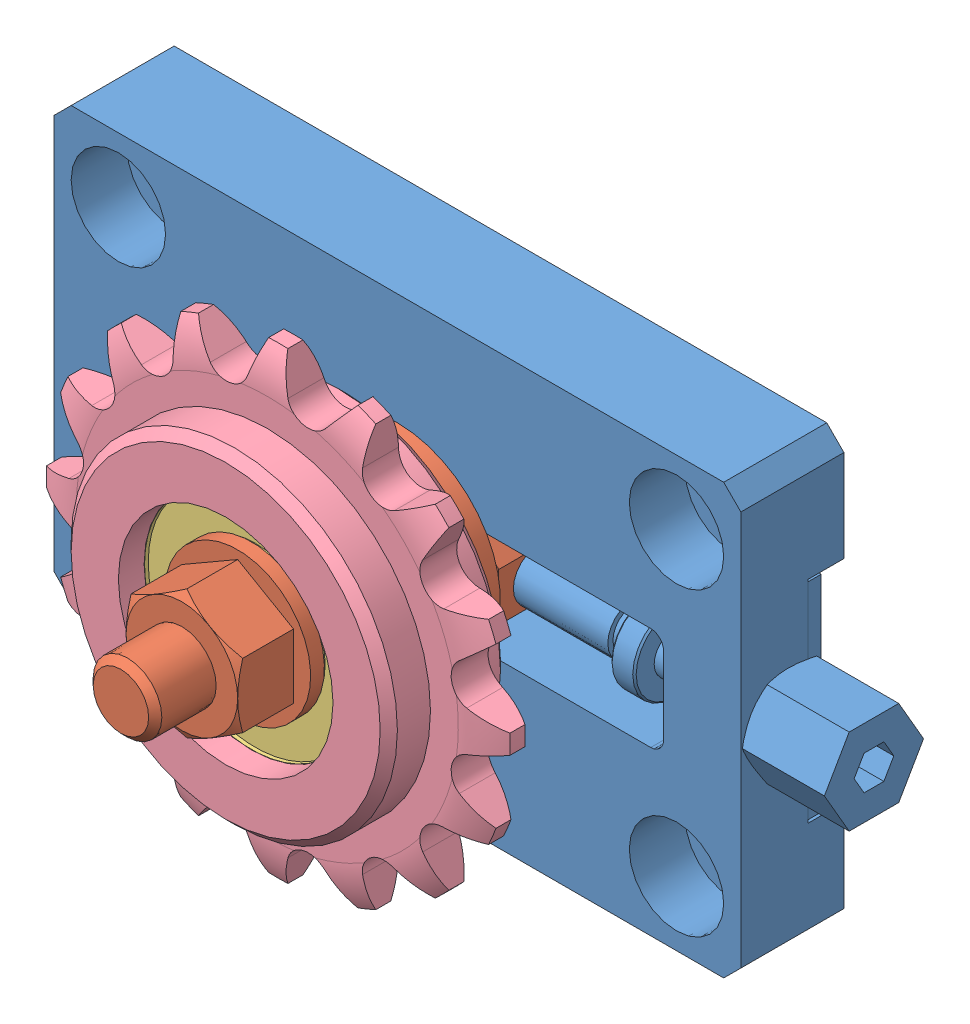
SolidWorks assembly sprocket slide tensioner.SLDASM, configuration Default (file format 12000). Lengths in mm.
Overall size (90.5 54 44.2).
5 component instances, 5 part files, 0 mates.
Components (placement in the parent):
- _TSUB35-16-25_p-1: _TSUB35-16-25_p.sldprt [Default] at origin size (90.5 50 12.77)
- _TSUB35-16-25_pi-1: _TSUB35-16-25_pi.sldprt [Default] x (1 0 0) z (0 -1 0) size (24 44 24)
- _bearing_6001-1: _bearing_6001.sldprt [Default] at (0 0 22) x (0 0 -1) z (-1 0 0) size (8 28 28)
- _DRC35-16-12_s-1: _DRC35-16-12_s.sldprt [Default] at (0 0 18) x (0 0 1) z (-1 0 0) size (14 54 54)
- _RRING-C-INT-28-1: _RRING-C-INT-28.sldprt [Default] at (0 0 13.4) x (0 0 -1) z (-1 0 0) size (1.2 28.16 29.4)
